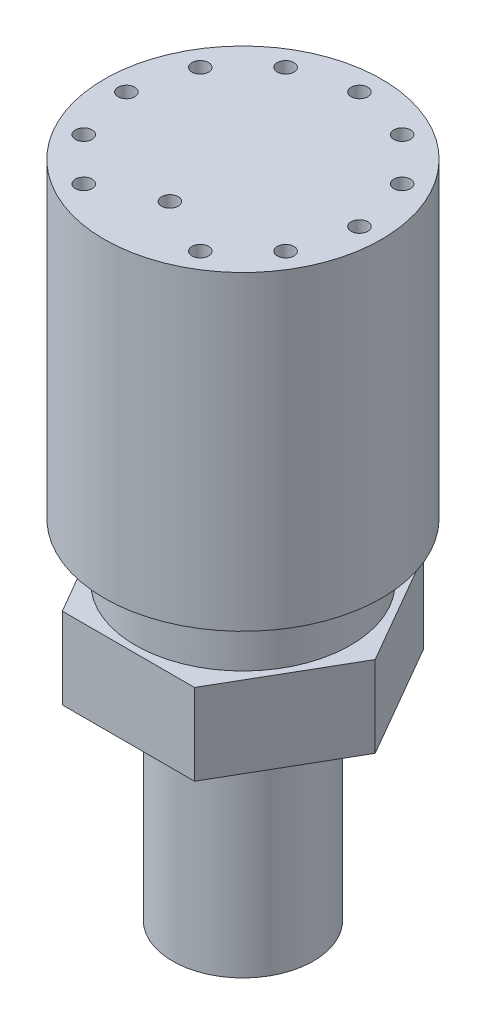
from build123d import *

# Parameters (mm, degrees)
EXTRUDE1_DEPTH        = 7.32
SKETCH2_R             = 9.695211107
EXTRUDE2_DEPTH        = 5.08
SKETCH3_R             = 12.5
EXTRUDE3_DEPTH        = 28
SKETCH4_R             = 5.5
EXTRUDE4_DEPTH        = 2.8194
SKETCH5_R             = 6.35
F_1_2_20_UNF_2A_DEPTH = 16.1806
SKETCH6_W             = 2.5654
SKETCH6_H             = 1.27
SKETCH7_R             = 0.75
EXTRUDE5_DEPTH        = 12
CIRPATTERN1_COUNT     = 12
SKETCH8_R             = 0.75
EXTRUDE6_DEPTH        = 12


with BuildPart() as part:
    # Sketch1 → Extrude1 (new body)
    with BuildSketch(Plane(origin=(0, 0, 0), x_dir=(1, 0, 0), z_dir=(0, 1, 0))):
        Polygon((11.91506618, 0), (5.95753309, 10.31875), (-5.95753309, 10.31875), (-11.91506618, 0), (-5.95753309, -10.31875), (5.95753309, -10.31875), align=None)
    extrude(amount=EXTRUDE1_DEPTH)

    # Sketch2 → Extrude2 (add)
    with BuildSketch(Plane(origin=(0, 7.32, 0), x_dir=(-1, 0, 0), z_dir=(0, 1, 0))):
        with Locations(Location((0, 0, 0), (0, 0, 270))):
            Circle(SKETCH2_R)
    extrude(amount=EXTRUDE2_DEPTH)

    # Sketch3 → Extrude3 (add)
    with BuildSketch(Plane(origin=(0, 12.4, 0), x_dir=(-1, 0, 0), z_dir=(0, 1, 0))):
        with Locations(Location((0, 0, 0), (0, 0, 90))):
            Circle(SKETCH3_R)
    extrude(amount=EXTRUDE3_DEPTH)

    # Sketch4 → Extrude4 (add)
    with BuildSketch(Plane.XZ):
        with Locations(Location((0, 0, 0), (0, 0, 270))):
            Circle(SKETCH4_R)
    extrude(amount=EXTRUDE4_DEPTH)

    # Sketch5 → 1_2-20-UNF-2A (add)
    with BuildSketch(Plane.XZ.offset(2.8194)):
        with Locations(Location((0, 0, 0), (0, 0, 270))):
            Circle(SKETCH5_R)
    extrude(amount=F_1_2_20_UNF_2A_DEPTH)

    # Sketch6 → 14mm x 1.78 (revolve, cut)
    with BuildSketch(Plane.XY, mode=Mode.PRIVATE) as f_14mm_x_1_78_sk:
        with Locations((7.5327, 0.635)):
            Rectangle(SKETCH6_W, SKETCH6_H)
    revolve(f_14mm_x_1_78_sk.sketch.rotate(Axis((0, 0, 0), (0, 1, 0)), 90), axis=Axis((0, 0, 0), (0, 1, 0)), mode=Mode.SUBTRACT)

    # Sketch7 → Extrude5 (cut)
    with BuildSketch(Plane(origin=(0, 40.4, 0), x_dir=(1, 0, 0), z_dir=(0, 1, 0))):
        with Locations(Location((0, 10.5, 0), (0, 0, 270))):
            Circle(SKETCH7_R)
    extrude5 = extrude(amount=-EXTRUDE5_DEPTH, mode=Mode.SUBTRACT)

    # CirPattern1: Extrude5 ×12 about axis, 1 skipped
    cirpattern1_axis = Axis((0, 0, 0), (0, -1, 0))
    add([extrude5.rotate(cirpattern1_axis, i * 360 / CIRPATTERN1_COUNT) for i in range(1, CIRPATTERN1_COUNT) if i not in (6,)], mode=Mode.SUBTRACT)

    # Sketch8 → Extrude6 (cut)
    with BuildSketch(Plane(origin=(0, 40.4, 0), x_dir=(1, 0, 0), z_dir=(0, 1, 0))):
        with Locations(Location((0, -6.582078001, 0), (0, 0, 270))):
            Circle(SKETCH8_R)
    extrude(amount=-EXTRUDE6_DEPTH, mode=Mode.SUBTRACT)


solid = part.part
